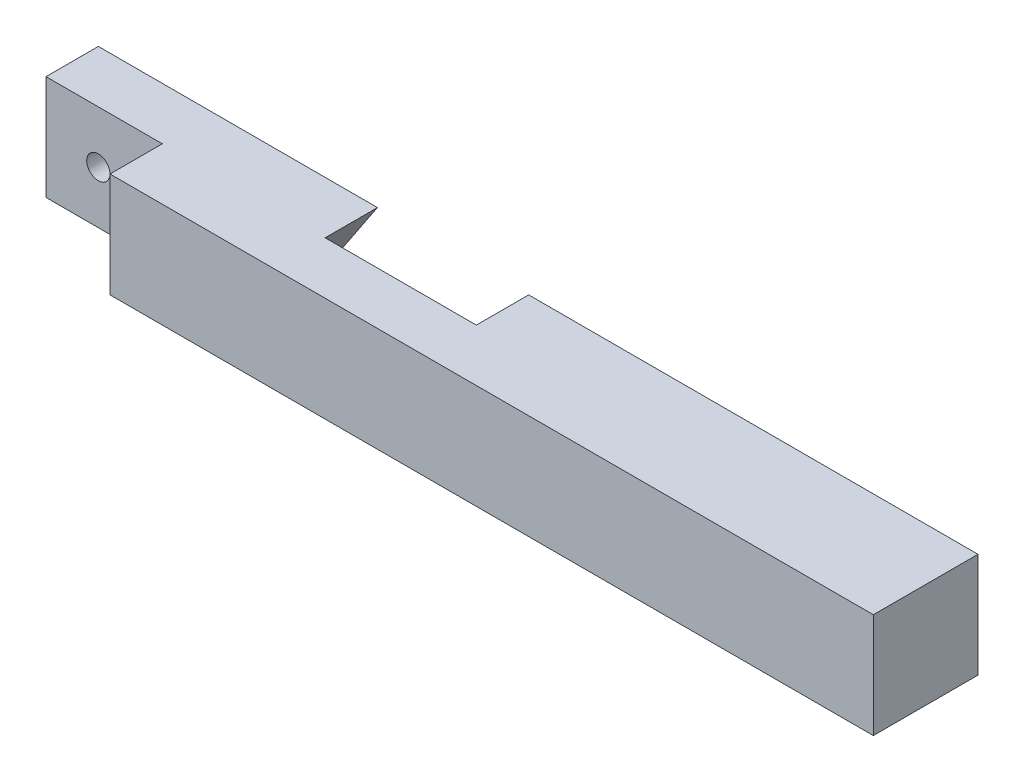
ISO-10303-21;
HEADER;
FILE_DESCRIPTION(('STEP AP214'),'2;1');
FILE_NAME('part.step','',(''),(''),'','','');
FILE_SCHEMA(('AUTOMOTIVE_DESIGN { 1 0 10303 214 1 1 1 1 }'));
ENDSEC;
DATA;
#1=APPLICATION_CONTEXT('core data for automotive mechanical design processes');
#2=APPLICATION_PROTOCOL_DEFINITION('international standard','automotive_design',2000,#1);
#3=PRODUCT_CONTEXT('',#1,'mechanical');
#4=PRODUCT('Part','Part','',(#3));
#5=PRODUCT_RELATED_PRODUCT_CATEGORY('part','',(#4));
#6=PRODUCT_DEFINITION_FORMATION('','',#4);
#7=PRODUCT_DEFINITION_CONTEXT('part definition',#1,'design');
#8=PRODUCT_DEFINITION('design','',#6,#7);
#9=PRODUCT_DEFINITION_SHAPE('','',#8);
#10=(LENGTH_UNIT() NAMED_UNIT(*) SI_UNIT(.MILLI.,.METRE.));
#11=(NAMED_UNIT(*) PLANE_ANGLE_UNIT() SI_UNIT($,.RADIAN.));
#12=(NAMED_UNIT(*) SI_UNIT($,.STERADIAN.) SOLID_ANGLE_UNIT());
#13=UNCERTAINTY_MEASURE_WITH_UNIT(LENGTH_MEASURE(1.E-05),#10,'distance_accuracy_value','');
#14=(GEOMETRIC_REPRESENTATION_CONTEXT(3) GLOBAL_UNCERTAINTY_ASSIGNED_CONTEXT((#13)) GLOBAL_UNIT_ASSIGNED_CONTEXT((#10,
#11,#12)) REPRESENTATION_CONTEXT('',''));
#15=CARTESIAN_POINT('',(0.,0.,0.));
#16=DIRECTION('',(0.,0.,1.));
#17=DIRECTION('',(1.,0.,0.));
#18=AXIS2_PLACEMENT_3D('',#15,#16,#17);
#19=CARTESIAN_POINT('',(0.,9.,0.));
#20=DIRECTION('',(0.,0.,-1.));
#21=DIRECTION('',(-1.,0.,0.));
#22=AXIS2_PLACEMENT_3D('',#19,#20,#21);
#23=PLANE('',#22);
#24=DIRECTION('',(-0.55470019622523,-0.832050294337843,0.));
#25=VECTOR('',#24,1.);
#26=CARTESIAN_POINT('',(37.,9.,0.));
#27=LINE('',#26,#25);
#28=CARTESIAN_POINT('',(37.,9.,0.));
#29=VERTEX_POINT('',#28);
#30=CARTESIAN_POINT('',(31.,0.,0.));
#31=VERTEX_POINT('',#30);
#32=EDGE_CURVE('E122',#29,#31,#27,.T.);
#33=ORIENTED_EDGE('',*,*,#32,.F.);
#34=DIRECTION('',(-1.,0.,0.));
#35=VECTOR('',#34,1.);
#36=CARTESIAN_POINT('',(0.,9.,0.));
#37=LINE('',#36,#35);
#38=CARTESIAN_POINT('',(75.63,9.,0.));
#39=VERTEX_POINT('',#38);
#40=EDGE_CURVE('E161',#39,#29,#37,.T.);
#41=ORIENTED_EDGE('',*,*,#40,.F.);
#42=DIRECTION('',(0.,1.,0.));
#43=VECTOR('',#42,1.);
#44=CARTESIAN_POINT('',(75.63,0.,0.));
#45=LINE('',#44,#43);
#46=CARTESIAN_POINT('',(75.63,0.,0.));
#47=VERTEX_POINT('',#46);
#48=EDGE_CURVE('E171',#47,#39,#45,.T.);
#49=ORIENTED_EDGE('',*,*,#48,.F.);
#50=DIRECTION('',(1.,0.,0.));
#51=VECTOR('',#50,1.);
#52=CARTESIAN_POINT('',(0.,0.,0.));
#53=LINE('',#52,#51);
#54=EDGE_CURVE('E169',#31,#47,#53,.T.);
#55=ORIENTED_EDGE('',*,*,#54,.F.);
#56=EDGE_LOOP('',(#33,#41,#49,#55));
#57=FACE_BOUND('',#56,.T.);
#58=ADVANCED_FACE('F31',(#57),#23,.T.);
#59=CARTESIAN_POINT('',(0.,0.,9.));
#60=DIRECTION('',(1.,0.,0.));
#61=DIRECTION('',(0.,0.,-1.));
#62=AXIS2_PLACEMENT_3D('',#59,#60,#61);
#63=PLANE('',#62);
#64=DIRECTION('',(0.,-1.,0.));
#65=VECTOR('',#64,1.);
#66=CARTESIAN_POINT('',(0.,9.,4.5));
#67=LINE('',#66,#65);
#68=CARTESIAN_POINT('',(0.,9.,4.5));
#69=VERTEX_POINT('',#68);
#70=CARTESIAN_POINT('',(0.,0.,4.5));
#71=VERTEX_POINT('',#70);
#72=EDGE_CURVE('E142',#69,#71,#67,.T.);
#73=ORIENTED_EDGE('',*,*,#72,.F.);
#74=DIRECTION('',(0.,0.,-1.));
#75=VECTOR('',#74,1.);
#76=CARTESIAN_POINT('',(0.,9.,9.));
#77=LINE('',#76,#75);
#78=CARTESIAN_POINT('',(0.,9.,0.));
#79=VERTEX_POINT('',#78);
#80=EDGE_CURVE('E166',#69,#79,#77,.T.);
#81=ORIENTED_EDGE('',*,*,#80,.T.);
#82=DIRECTION('',(0.,-1.,0.));
#83=VECTOR('',#82,1.);
#84=CARTESIAN_POINT('',(0.,0.,0.));
#85=LINE('',#84,#83);
#86=CARTESIAN_POINT('',(0.,0.,0.));
#87=VERTEX_POINT('',#86);
#88=EDGE_CURVE('E156',#79,#87,#85,.T.);
#89=ORIENTED_EDGE('',*,*,#88,.T.);
#90=DIRECTION('',(0.,0.,-1.));
#91=VECTOR('',#90,1.);
#92=CARTESIAN_POINT('',(0.,0.,9.));
#93=LINE('',#92,#91);
#94=EDGE_CURVE('E11',#71,#87,#93,.T.);
#95=ORIENTED_EDGE('',*,*,#94,.F.);
#96=EDGE_LOOP('',(#73,#81,#89,#95));
#97=FACE_BOUND('',#96,.T.);
#98=ADVANCED_FACE('F33',(#97),#63,.F.);
#99=CARTESIAN_POINT('',(0.,0.,9.));
#100=DIRECTION('',(0.,1.,0.));
#101=DIRECTION('',(0.,0.,1.));
#102=AXIS2_PLACEMENT_3D('',#99,#100,#101);
#103=PLANE('',#102);
#104=DIRECTION('',(-1.,0.,0.));
#105=VECTOR('',#104,1.);
#106=CARTESIAN_POINT('',(31.,0.,4.5));
#107=LINE('',#106,#105);
#108=CARTESIAN_POINT('',(31.,0.,4.5));
#109=VERTEX_POINT('',#108);
#110=CARTESIAN_POINT('',(18.,0.,4.5));
#111=VERTEX_POINT('',#110);
#112=EDGE_CURVE('E113',#109,#111,#107,.T.);
#113=ORIENTED_EDGE('',*,*,#112,.F.);
#114=DIRECTION('',(0.,0.,-1.));
#115=VECTOR('',#114,1.);
#116=CARTESIAN_POINT('',(31.,0.,4.5));
#117=LINE('',#116,#115);
#118=EDGE_CURVE('E141',#109,#31,#117,.T.);
#119=ORIENTED_EDGE('',*,*,#118,.T.);
#120=ORIENTED_EDGE('',*,*,#54,.T.);
#121=DIRECTION('',(0.,0.,-1.));
#122=VECTOR('',#121,1.);
#123=CARTESIAN_POINT('',(75.63,0.,9.));
#124=LINE('',#123,#122);
#125=CARTESIAN_POINT('',(75.63,0.,9.));
#126=VERTEX_POINT('',#125);
#127=EDGE_CURVE('E39',#126,#47,#124,.T.);
#128=ORIENTED_EDGE('',*,*,#127,.F.);
#129=DIRECTION('',(1.,0.,0.));
#130=VECTOR('',#129,1.);
#131=CARTESIAN_POINT('',(0.,0.,9.));
#132=LINE('',#131,#130);
#133=CARTESIAN_POINT('',(10.,0.,9.));
#134=VERTEX_POINT('',#133);
#135=EDGE_CURVE('E158',#134,#126,#132,.T.);
#136=ORIENTED_EDGE('',*,*,#135,.F.);
#137=DIRECTION('',(0.,0.,1.));
#138=VECTOR('',#137,1.);
#139=CARTESIAN_POINT('',(10.,0.,4.5));
#140=LINE('',#139,#138);
#141=CARTESIAN_POINT('',(10.,0.,4.5));
#142=VERTEX_POINT('',#141);
#143=EDGE_CURVE('E54',#142,#134,#140,.T.);
#144=ORIENTED_EDGE('',*,*,#143,.F.);
#145=DIRECTION('',(1.,0.,0.));
#146=VECTOR('',#145,1.);
#147=CARTESIAN_POINT('',(0.,0.,4.5));
#148=LINE('',#147,#146);
#149=EDGE_CURVE('E144',#71,#142,#148,.T.);
#150=ORIENTED_EDGE('',*,*,#149,.F.);
#151=ORIENTED_EDGE('',*,*,#94,.T.);
#152=CARTESIAN_POINT('',(18.,0.,0.));
#153=VERTEX_POINT('',#152);
#154=EDGE_CURVE('E127',#87,#153,#53,.T.);
#155=ORIENTED_EDGE('',*,*,#154,.T.);
#156=DIRECTION('',(0.,0.,-1.));
#157=VECTOR('',#156,1.);
#158=CARTESIAN_POINT('',(18.,0.,4.5));
#159=LINE('',#158,#157);
#160=EDGE_CURVE('E46',#111,#153,#159,.T.);
#161=ORIENTED_EDGE('',*,*,#160,.F.);
#162=EDGE_LOOP('',(#113,#119,#120,#128,#136,#144,#150,#151,#155,#161));
#163=FACE_BOUND('',#162,.T.);
#164=ADVANCED_FACE('F125',(#163),#103,.F.);
#165=CARTESIAN_POINT('',(75.63,0.,9.));
#166=DIRECTION('',(-1.,0.,0.));
#167=DIRECTION('',(0.,0.,1.));
#168=AXIS2_PLACEMENT_3D('',#165,#166,#167);
#169=PLANE('',#168);
#170=ORIENTED_EDGE('',*,*,#48,.T.);
#171=DIRECTION('',(0.,0.,-1.));
#172=VECTOR('',#171,1.);
#173=CARTESIAN_POINT('',(75.63,9.,9.));
#174=LINE('',#173,#172);
#175=CARTESIAN_POINT('',(75.63,9.,9.));
#176=VERTEX_POINT('',#175);
#177=EDGE_CURVE('E178',#176,#39,#174,.T.);
#178=ORIENTED_EDGE('',*,*,#177,.F.);
#179=DIRECTION('',(0.,1.,0.));
#180=VECTOR('',#179,1.);
#181=CARTESIAN_POINT('',(75.63,0.,9.));
#182=LINE('',#181,#180);
#183=EDGE_CURVE('E160',#126,#176,#182,.T.);
#184=ORIENTED_EDGE('',*,*,#183,.F.);
#185=ORIENTED_EDGE('',*,*,#127,.T.);
#186=EDGE_LOOP('',(#170,#178,#184,#185));
#187=FACE_BOUND('',#186,.T.);
#188=ADVANCED_FACE('F185',(#187),#169,.F.);
#189=CARTESIAN_POINT('',(0.,9.,9.));
#190=DIRECTION('',(0.,-1.,0.));
#191=DIRECTION('',(0.,0.,-1.));
#192=AXIS2_PLACEMENT_3D('',#189,#190,#191);
#193=PLANE('',#192);
#194=ORIENTED_EDGE('',*,*,#40,.T.);
#195=DIRECTION('',(0.,0.,-1.));
#196=VECTOR('',#195,1.);
#197=CARTESIAN_POINT('',(37.,9.,4.5));
#198=LINE('',#197,#196);
#199=CARTESIAN_POINT('',(37.,9.,4.5));
#200=VERTEX_POINT('',#199);
#201=EDGE_CURVE('E129',#200,#29,#198,.T.);
#202=ORIENTED_EDGE('',*,*,#201,.F.);
#203=DIRECTION('',(1.,0.,0.));
#204=VECTOR('',#203,1.);
#205=CARTESIAN_POINT('',(24.,9.,4.5));
#206=LINE('',#205,#204);
#207=CARTESIAN_POINT('',(24.,9.,4.5));
#208=VERTEX_POINT('',#207);
#209=EDGE_CURVE('E112',#208,#200,#206,.T.);
#210=ORIENTED_EDGE('',*,*,#209,.F.);
#211=DIRECTION('',(0.,0.,-1.));
#212=VECTOR('',#211,1.);
#213=CARTESIAN_POINT('',(24.,9.,4.5));
#214=LINE('',#213,#212);
#215=CARTESIAN_POINT('',(24.,9.,0.));
#216=VERTEX_POINT('',#215);
#217=EDGE_CURVE('E109',#208,#216,#214,.T.);
#218=ORIENTED_EDGE('',*,*,#217,.T.);
#219=EDGE_CURVE('E173',#216,#79,#37,.T.);
#220=ORIENTED_EDGE('',*,*,#219,.T.);
#221=ORIENTED_EDGE('',*,*,#80,.F.);
#222=DIRECTION('',(-1.,0.,0.));
#223=VECTOR('',#222,1.);
#224=CARTESIAN_POINT('',(0.,9.,4.5));
#225=LINE('',#224,#223);
#226=CARTESIAN_POINT('',(10.,9.,4.5));
#227=VERTEX_POINT('',#226);
#228=EDGE_CURVE('E150',#227,#69,#225,.T.);
#229=ORIENTED_EDGE('',*,*,#228,.F.);
#230=DIRECTION('',(0.,0.,1.));
#231=VECTOR('',#230,1.);
#232=CARTESIAN_POINT('',(10.,9.,4.5));
#233=LINE('',#232,#231);
#234=CARTESIAN_POINT('',(10.,9.,9.));
#235=VERTEX_POINT('',#234);
#236=EDGE_CURVE('E153',#227,#235,#233,.T.);
#237=ORIENTED_EDGE('',*,*,#236,.T.);
#238=DIRECTION('',(-1.,0.,0.));
#239=VECTOR('',#238,1.);
#240=CARTESIAN_POINT('',(0.,9.,9.));
#241=LINE('',#240,#239);
#242=EDGE_CURVE('E163',#176,#235,#241,.T.);
#243=ORIENTED_EDGE('',*,*,#242,.F.);
#244=ORIENTED_EDGE('',*,*,#177,.T.);
#245=EDGE_LOOP('',(#194,#202,#210,#218,#220,#221,#229,#237,#243,#244));
#246=FACE_BOUND('',#245,.T.);
#247=ADVANCED_FACE('F194',(#246),#193,.F.);
#248=CARTESIAN_POINT('',(0.,9.,9.));
#249=DIRECTION('',(0.,0.,-1.));
#250=DIRECTION('',(-1.,0.,0.));
#251=AXIS2_PLACEMENT_3D('',#248,#249,#250);
#252=PLANE('',#251);
#253=ORIENTED_EDGE('',*,*,#242,.T.);
#254=DIRECTION('',(0.,1.,0.));
#255=VECTOR('',#254,1.);
#256=CARTESIAN_POINT('',(10.,9.,9.));
#257=LINE('',#256,#255);
#258=EDGE_CURVE('E137',#134,#235,#257,.T.);
#259=ORIENTED_EDGE('',*,*,#258,.F.);
#260=ORIENTED_EDGE('',*,*,#135,.T.);
#261=ORIENTED_EDGE('',*,*,#183,.T.);
#262=EDGE_LOOP('',(#253,#259,#260,#261));
#263=FACE_BOUND('',#262,.T.);
#264=ADVANCED_FACE('F198',(#263),#252,.F.);
#265=DIRECTION('',(0.554700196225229,0.832050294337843,0.));
#266=VECTOR('',#265,1.);
#267=CARTESIAN_POINT('',(18.,0.,0.));
#268=LINE('',#267,#266);
#269=EDGE_CURVE('E210',#153,#216,#268,.T.);
#270=ORIENTED_EDGE('',*,*,#269,.F.);
#271=ORIENTED_EDGE('',*,*,#154,.F.);
#272=ORIENTED_EDGE('',*,*,#88,.F.);
#273=ORIENTED_EDGE('',*,*,#219,.F.);
#274=EDGE_LOOP('',(#270,#271,#272,#273));
#275=FACE_BOUND('',#274,.T.);
#276=CARTESIAN_POINT('',(4.5,4.5,0.));
#277=DIRECTION('',(0.,0.,1.));
#278=DIRECTION('',(1.,0.,0.));
#279=AXIS2_PLACEMENT_3D('',#276,#277,#278);
#280=CIRCLE('',#279,1.);
#281=CARTESIAN_POINT('',(5.5,4.5,0.));
#282=VERTEX_POINT('',#281);
#283=EDGE_CURVE('E134',#282,#282,#280,.T.);
#284=ORIENTED_EDGE('',*,*,#283,.T.);
#285=EDGE_LOOP('',(#284));
#286=FACE_BOUND('',#285,.T.);
#287=ADVANCED_FACE('F208',(#275,#286),#23,.T.);
#288=CARTESIAN_POINT('',(10.,9.,4.5));
#289=DIRECTION('',(1.,0.,0.));
#290=DIRECTION('',(0.,1.,0.));
#291=AXIS2_PLACEMENT_3D('',#288,#289,#290);
#292=PLANE('',#291);
#293=ORIENTED_EDGE('',*,*,#258,.T.);
#294=ORIENTED_EDGE('',*,*,#236,.F.);
#295=DIRECTION('',(0.,1.,0.));
#296=VECTOR('',#295,1.);
#297=CARTESIAN_POINT('',(10.,9.,4.5));
#298=LINE('',#297,#296);
#299=EDGE_CURVE('E147',#142,#227,#298,.T.);
#300=ORIENTED_EDGE('',*,*,#299,.F.);
#301=ORIENTED_EDGE('',*,*,#143,.T.);
#302=EDGE_LOOP('',(#293,#294,#300,#301));
#303=FACE_BOUND('',#302,.T.);
#304=ADVANCED_FACE('F237',(#303),#292,.F.);
#305=CARTESIAN_POINT('',(0.,0.,4.5));
#306=DIRECTION('',(0.,0.,1.));
#307=DIRECTION('',(1.,0.,0.));
#308=AXIS2_PLACEMENT_3D('',#305,#306,#307);
#309=PLANE('',#308);
#310=CARTESIAN_POINT('',(4.5,4.5,4.5));
#311=DIRECTION('',(0.,0.,1.));
#312=DIRECTION('',(1.,0.,0.));
#313=AXIS2_PLACEMENT_3D('',#310,#311,#312);
#314=CIRCLE('',#313,1.);
#315=CARTESIAN_POINT('',(5.5,4.5,4.5));
#316=VERTEX_POINT('',#315);
#317=EDGE_CURVE('E138',#316,#316,#314,.T.);
#318=ORIENTED_EDGE('',*,*,#317,.F.);
#319=EDGE_LOOP('',(#318));
#320=FACE_BOUND('',#319,.T.);
#321=ORIENTED_EDGE('',*,*,#72,.T.);
#322=ORIENTED_EDGE('',*,*,#149,.T.);
#323=ORIENTED_EDGE('',*,*,#299,.T.);
#324=ORIENTED_EDGE('',*,*,#228,.T.);
#325=EDGE_LOOP('',(#321,#322,#323,#324));
#326=FACE_BOUND('',#325,.T.);
#327=ADVANCED_FACE('F225',(#320,#326),#309,.T.);
#328=CARTESIAN_POINT('',(4.5,4.5,0.));
#329=DIRECTION('',(0.,0.,1.));
#330=DIRECTION('',(1.,0.,0.));
#331=AXIS2_PLACEMENT_3D('',#328,#329,#330);
#332=CYLINDRICAL_SURFACE('',#331,1.);
#333=ORIENTED_EDGE('',*,*,#283,.F.);
#334=EDGE_LOOP('',(#333));
#335=FACE_BOUND('',#334,.T.);
#336=ORIENTED_EDGE('',*,*,#317,.T.);
#337=EDGE_LOOP('',(#336));
#338=FACE_BOUND('',#337,.T.);
#339=ADVANCED_FACE('F218',(#335,#338),#332,.F.);
#340=CARTESIAN_POINT('',(37.,9.,4.5));
#341=DIRECTION('',(0.832050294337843,-0.55470019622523,0.));
#342=DIRECTION('',(0.55470019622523,0.832050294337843,0.));
#343=AXIS2_PLACEMENT_3D('',#340,#341,#342);
#344=PLANE('',#343);
#345=ORIENTED_EDGE('',*,*,#32,.T.);
#346=ORIENTED_EDGE('',*,*,#118,.F.);
#347=DIRECTION('',(-0.55470019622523,-0.832050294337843,0.));
#348=VECTOR('',#347,1.);
#349=CARTESIAN_POINT('',(37.,9.,4.5));
#350=LINE('',#349,#348);
#351=EDGE_CURVE('E119',#200,#109,#350,.T.);
#352=ORIENTED_EDGE('',*,*,#351,.F.);
#353=ORIENTED_EDGE('',*,*,#201,.T.);
#354=EDGE_LOOP('',(#345,#346,#352,#353));
#355=FACE_BOUND('',#354,.T.);
#356=ADVANCED_FACE('F216',(#355),#344,.F.);
#357=CARTESIAN_POINT('',(18.,0.,4.5));
#358=DIRECTION('',(-0.832050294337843,0.554700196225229,0.));
#359=DIRECTION('',(-0.554700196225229,-0.832050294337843,0.));
#360=AXIS2_PLACEMENT_3D('',#357,#358,#359);
#361=PLANE('',#360);
#362=ORIENTED_EDGE('',*,*,#269,.T.);
#363=ORIENTED_EDGE('',*,*,#217,.F.);
#364=DIRECTION('',(0.554700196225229,0.832050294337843,0.));
#365=VECTOR('',#364,1.);
#366=CARTESIAN_POINT('',(18.,0.,4.5));
#367=LINE('',#366,#365);
#368=EDGE_CURVE('E105',#111,#208,#367,.T.);
#369=ORIENTED_EDGE('',*,*,#368,.F.);
#370=ORIENTED_EDGE('',*,*,#160,.T.);
#371=EDGE_LOOP('',(#362,#363,#369,#370));
#372=FACE_BOUND('',#371,.T.);
#373=ADVANCED_FACE('F107',(#372),#361,.F.);
#374=CARTESIAN_POINT('',(18.,0.,4.5));
#375=DIRECTION('',(0.,0.,-1.));
#376=DIRECTION('',(-1.,0.,0.));
#377=AXIS2_PLACEMENT_3D('',#374,#375,#376);
#378=PLANE('',#377);
#379=ORIENTED_EDGE('',*,*,#112,.T.);
#380=ORIENTED_EDGE('',*,*,#368,.T.);
#381=ORIENTED_EDGE('',*,*,#209,.T.);
#382=ORIENTED_EDGE('',*,*,#351,.T.);
#383=EDGE_LOOP('',(#379,#380,#381,#382));
#384=FACE_BOUND('',#383,.T.);
#385=ADVANCED_FACE('F117',(#384),#378,.T.);
#386=CLOSED_SHELL('',(#58,#98,#164,#188,#247,#264,#287,#304,#327,#339,#356,#373,#385));
#387=MANIFOLD_SOLID_BREP('B2',#386);
#388=ADVANCED_BREP_SHAPE_REPRESENTATION('',(#18,#387),#14);
#389=SHAPE_DEFINITION_REPRESENTATION(#9,#388);
ENDSEC;
END-ISO-10303-21;
